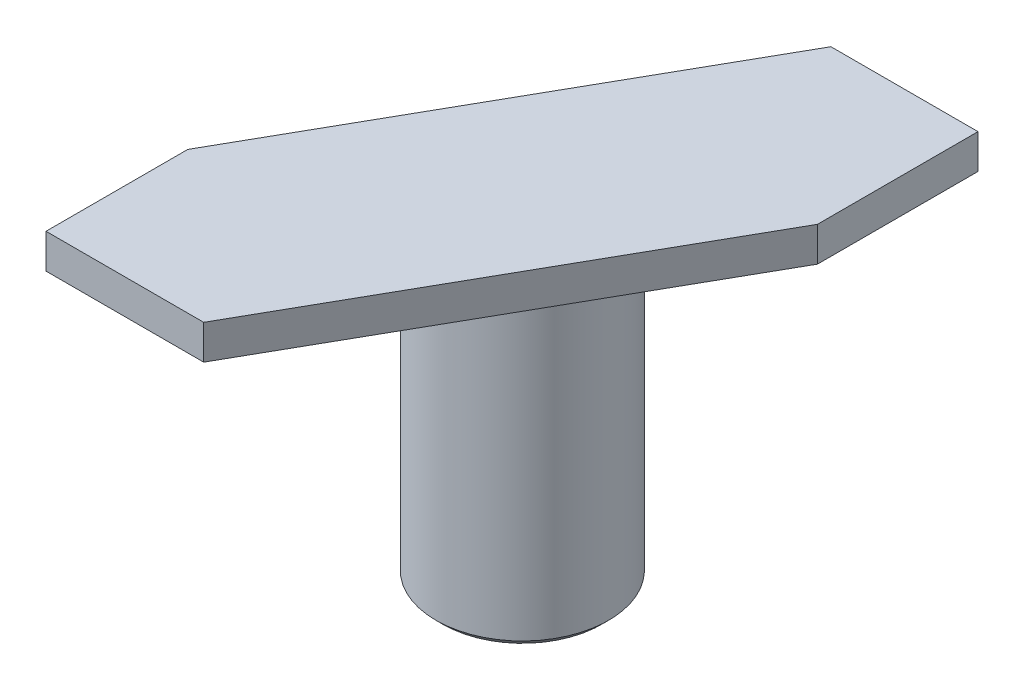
from build123d import *

# Parameters (mm, degrees)
DODANIE_WYCI_GNI_CIE1_DEPTH = 1
SZKIC2_R                    = 2.5
DODANIE_WYCI_GNI_CIE2_DEPTH = 9
WYTNIJ_WYCI_GNI_CIE1_DEPTH  = 1
SFAZOWANIE1_SIZE            = 0.2


with BuildPart() as part:
    # Szkic1 → Dodanie-wyci_gni_cie1 (new body)
    with BuildSketch(Plane(origin=(0, 0, 0), x_dir=(1, 0, 0), z_dir=(0, 1, 0))):
        Polygon((1.127230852, 4.651075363), (5.387944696, 4.651075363), (5.387944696, 0), (-1.043465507, -11.348924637), (-5.612055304, -11.348924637), (-5.612055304, -7.241129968), align=None)
    extrude(amount=DODANIE_WYCI_GNI_CIE1_DEPTH)

    # Szkic2 → Dodanie-wyci_gni_cie2 (add)
    with BuildSketch(Plane(origin=(0, 0, 0), x_dir=(1, 0, 0), z_dir=(0, 1, 0))):
        with Locations(Location((0, -3.161899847, 0), (0, 0, 270))):
            Circle(SZKIC2_R)
    extrude(amount=-DODANIE_WYCI_GNI_CIE2_DEPTH)

    # Szkic3 → Wytnij-wyci_gni_cie1 (cut)
    with BuildSketch(Plane(origin=(0, -9, 0), x_dir=(-1, 0, 0), z_dir=(0, -1, 0))):
        Polygon((-1.463049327, -4.54997706), (-1.903178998, -3.826906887), (1.456608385, -1.781818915), (1.896738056, -2.504889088), align=None)
    extrude(amount=-WYTNIJ_WYCI_GNI_CIE1_DEPTH, mode=Mode.SUBTRACT)

    # Sfazowanie1
    sfazowanie1_edges = [part.edges().sort_by_distance(p)[0] for p in [
        (0, -9, 0.661899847),
    ]]
    chamfer(sfazowanie1_edges, length=SFAZOWANIE1_SIZE)


solid = part.part
